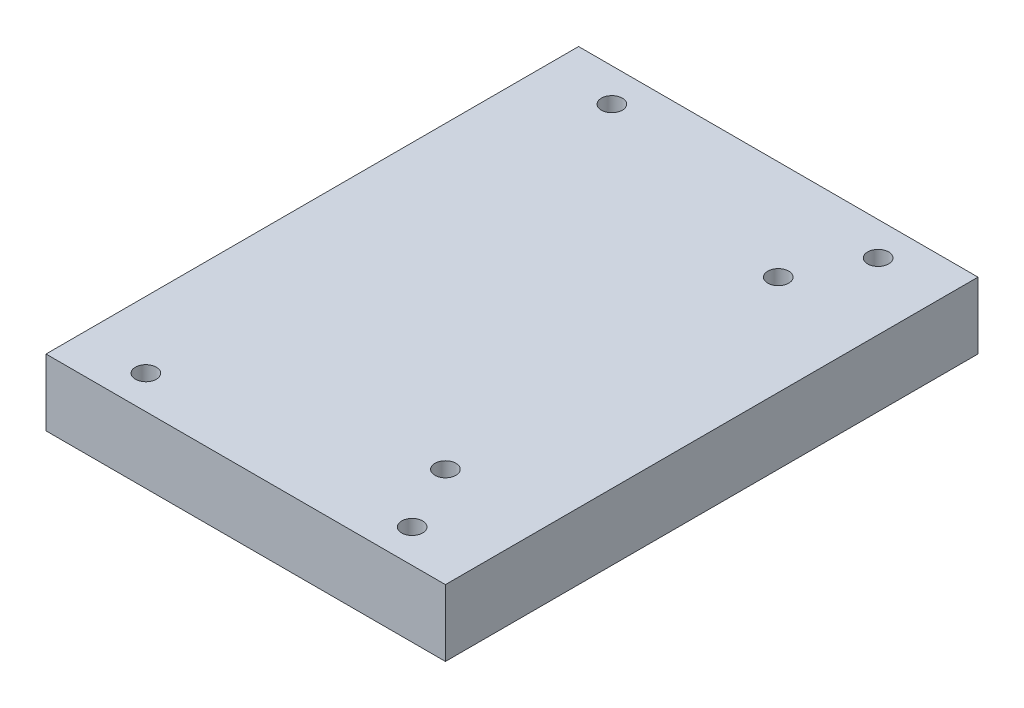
from build123d import *

# Parameters (mm, degrees)
SKETCH1_W                    = 76.2
SKETCH1_H                    = 101.6
BOSS_EXTRUDE1_DEPTH          = 12.7
F_4_0_4_DIAMETER_HOLE1_D     = 4
F_4_0_4_DIAMETER_HOLE1_DEPTH = 12.7
F_4_0_4_DIAMETER_HOLE1_TIP   = 1.201721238
SKETCH5_R                    = 2
CUT_EXTRUDE1_DEPTH           = 146.016246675


with BuildPart() as part:
    # Sketch1 → Boss-Extrude1 (new body)
    with BuildSketch(Plane(origin=(0, 0, 0), x_dir=(1, 0, 0), z_dir=(0, 1, 0))):
        with Locations((-85.889038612, -23.329212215)):
            Rectangle(SKETCH1_W, SKETCH1_H)
    extrude(amount=BOSS_EXTRUDE1_DEPTH)

    # 4.0 _4_ Diameter Hole1
    with Locations(Plane(origin=(-111.289038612, 12.7, 67.779212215), x_dir=(0, 0, 1), z_dir=(0, 1, 0))):
        with Locations((0, 0), (-88.9, 0), (-88.9, 50.8), (0, 50.8)):
            Hole(F_4_0_4_DIAMETER_HOLE1_D / 2, depth=F_4_0_4_DIAMETER_HOLE1_DEPTH)
            with Locations((0, 0, -(F_4_0_4_DIAMETER_HOLE1_DEPTH + F_4_0_4_DIAMETER_HOLE1_TIP / 2))):  # 118° drill point
                Cone(0, F_4_0_4_DIAMETER_HOLE1_D / 2, F_4_0_4_DIAMETER_HOLE1_TIP, mode=Mode.SUBTRACT)

    # Sketch5 → Cut-Extrude1 (cut, through all)
    with BuildSketch(Plane(origin=(0, 12.7, 0), x_dir=(1, 0, 0), z_dir=(0, 1, 0))):
        with Locations(Location((-66.839038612, 8.420787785, 0), (0, 0, 270))):
            Circle(SKETCH5_R)
        with Locations(Location((-66.839038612, -55.079212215, 0), (0, 0, 270))):
            Circle(SKETCH5_R)
    extrude(amount=-CUT_EXTRUDE1_DEPTH, mode=Mode.SUBTRACT)


solid = part.part
